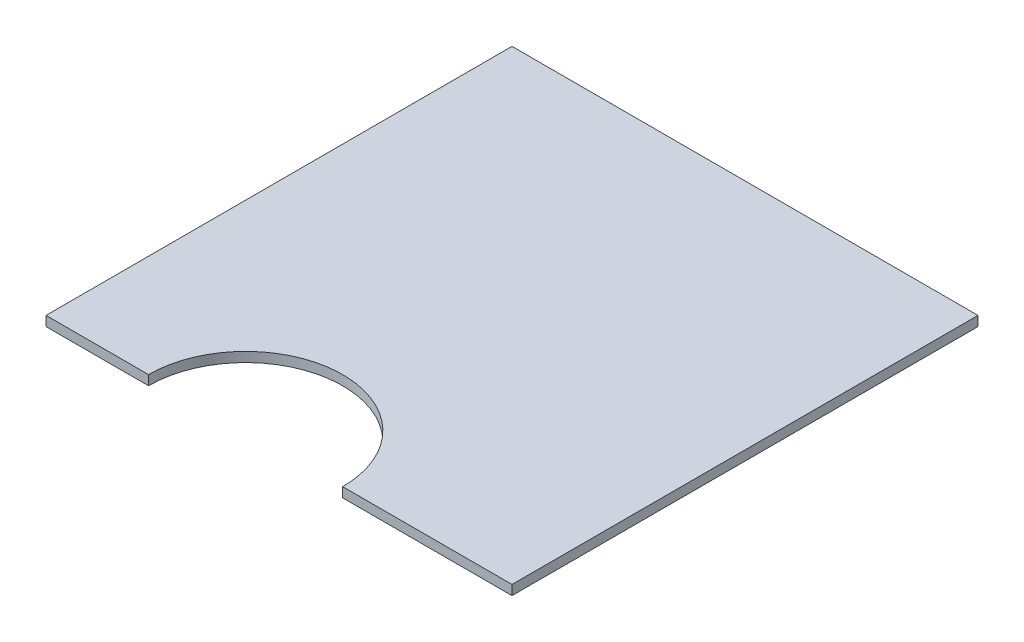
ISO-10303-21;
HEADER;
FILE_DESCRIPTION(('STEP AP214'),'2;1');
FILE_NAME('part.step','',(''),(''),'','','');
FILE_SCHEMA(('AUTOMOTIVE_DESIGN { 1 0 10303 214 1 1 1 1 }'));
ENDSEC;
DATA;
#1=APPLICATION_CONTEXT('core data for automotive mechanical design processes');
#2=APPLICATION_PROTOCOL_DEFINITION('international standard','automotive_design',2000,#1);
#3=PRODUCT_CONTEXT('',#1,'mechanical');
#4=PRODUCT('Part','Part','',(#3));
#5=PRODUCT_RELATED_PRODUCT_CATEGORY('part','',(#4));
#6=PRODUCT_DEFINITION_FORMATION('','',#4);
#7=PRODUCT_DEFINITION_CONTEXT('part definition',#1,'design');
#8=PRODUCT_DEFINITION('design','',#6,#7);
#9=PRODUCT_DEFINITION_SHAPE('','',#8);
#10=(LENGTH_UNIT() NAMED_UNIT(*) SI_UNIT(.MILLI.,.METRE.));
#11=(NAMED_UNIT(*) PLANE_ANGLE_UNIT() SI_UNIT($,.RADIAN.));
#12=(NAMED_UNIT(*) SI_UNIT($,.STERADIAN.) SOLID_ANGLE_UNIT());
#13=UNCERTAINTY_MEASURE_WITH_UNIT(LENGTH_MEASURE(1.E-05),#10,'distance_accuracy_value','');
#14=(GEOMETRIC_REPRESENTATION_CONTEXT(3) GLOBAL_UNCERTAINTY_ASSIGNED_CONTEXT((#13)) GLOBAL_UNIT_ASSIGNED_CONTEXT((#10,
#11,#12)) REPRESENTATION_CONTEXT('',''));
#15=CARTESIAN_POINT('',(0.,0.,0.));
#16=DIRECTION('',(0.,0.,1.));
#17=DIRECTION('',(1.,0.,0.));
#18=AXIS2_PLACEMENT_3D('',#15,#16,#17);
#19=CARTESIAN_POINT('',(-163.303385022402,6.35,27.2067696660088));
#20=DIRECTION('',(0.,-1.,0.));
#21=DIRECTION('',(0.,0.,-1.));
#22=AXIS2_PLACEMENT_3D('',#19,#20,#21);
#23=CYLINDRICAL_SURFACE('',#22,63.5);
#24=CARTESIAN_POINT('',(-163.303385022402,0.,27.2067696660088));
#25=DIRECTION('',(0.,1.,0.));
#26=DIRECTION('',(0.,0.,1.));
#27=AXIS2_PLACEMENT_3D('',#24,#25,#26);
#28=CIRCLE('',#27,63.5);
#29=CARTESIAN_POINT('',(-99.8033850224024,0.,27.2067696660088));
#30=VERTEX_POINT('',#29);
#31=CARTESIAN_POINT('',(-226.803385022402,0.,27.2067696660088));
#32=VERTEX_POINT('',#31);
#33=EDGE_CURVE('E115',#30,#32,#28,.T.);
#34=ORIENTED_EDGE('',*,*,#33,.F.);
#35=DIRECTION('',(0.,-1.,0.));
#36=VECTOR('',#35,1.);
#37=CARTESIAN_POINT('',(-99.8033850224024,6.35,27.2067696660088));
#38=LINE('',#37,#36);
#39=CARTESIAN_POINT('',(-99.8033850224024,6.35,27.2067696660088));
#40=VERTEX_POINT('',#39);
#41=EDGE_CURVE('E11',#40,#30,#38,.T.);
#42=ORIENTED_EDGE('',*,*,#41,.F.);
#43=CARTESIAN_POINT('',(-163.303385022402,6.35,27.2067696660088));
#44=DIRECTION('',(0.,1.,0.));
#45=DIRECTION('',(0.,0.,1.));
#46=AXIS2_PLACEMENT_3D('',#43,#44,#45);
#47=CIRCLE('',#46,63.5);
#48=CARTESIAN_POINT('',(-226.803385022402,6.35,27.2067696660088));
#49=VERTEX_POINT('',#48);
#50=EDGE_CURVE('E138',#40,#49,#47,.T.);
#51=ORIENTED_EDGE('',*,*,#50,.T.);
#52=DIRECTION('',(0.,-1.,0.));
#53=VECTOR('',#52,1.);
#54=CARTESIAN_POINT('',(-226.803385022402,6.35,27.2067696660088));
#55=LINE('',#54,#53);
#56=EDGE_CURVE('E77',#49,#32,#55,.T.);
#57=ORIENTED_EDGE('',*,*,#56,.T.);
#58=EDGE_LOOP('',(#34,#42,#51,#57));
#59=FACE_BOUND('',#58,.T.);
#60=ADVANCED_FACE('F33',(#59),#23,.F.);
#61=CARTESIAN_POINT('',(-476.867271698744,6.35,27.2067696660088));
#62=DIRECTION('',(0.,0.,-1.));
#63=DIRECTION('',(-1.,0.,0.));
#64=AXIS2_PLACEMENT_3D('',#61,#62,#63);
#65=PLANE('',#64);
#66=DIRECTION('',(1.,0.,0.));
#67=VECTOR('',#66,1.);
#68=CARTESIAN_POINT('',(-476.867271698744,0.,27.2067696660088));
#69=LINE('',#68,#67);
#70=CARTESIAN_POINT('',(10.9541496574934,0.,27.2067696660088));
#71=VERTEX_POINT('',#70);
#72=EDGE_CURVE('E118',#30,#71,#69,.T.);
#73=ORIENTED_EDGE('',*,*,#72,.T.);
#74=DIRECTION('',(0.,-1.,0.));
#75=VECTOR('',#74,1.);
#76=CARTESIAN_POINT('',(10.9541496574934,6.35,27.2067696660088));
#77=LINE('',#76,#75);
#78=CARTESIAN_POINT('',(10.9541496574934,6.35,27.2067696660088));
#79=VERTEX_POINT('',#78);
#80=EDGE_CURVE('E41',#79,#71,#77,.T.);
#81=ORIENTED_EDGE('',*,*,#80,.F.);
#82=DIRECTION('',(1.,0.,0.));
#83=VECTOR('',#82,1.);
#84=CARTESIAN_POINT('',(-476.867271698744,6.35,27.2067696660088));
#85=LINE('',#84,#83);
#86=EDGE_CURVE('E112',#40,#79,#85,.T.);
#87=ORIENTED_EDGE('',*,*,#86,.F.);
#88=ORIENTED_EDGE('',*,*,#41,.T.);
#89=EDGE_LOOP('',(#73,#81,#87,#88));
#90=FACE_BOUND('',#89,.T.);
#91=ADVANCED_FACE('F140',(#90),#65,.F.);
#92=CARTESIAN_POINT('',(10.9541496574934,6.35,-125.193230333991));
#93=DIRECTION('',(-1.,0.,0.));
#94=DIRECTION('',(0.,0.,1.));
#95=AXIS2_PLACEMENT_3D('',#92,#93,#94);
#96=PLANE('',#95);
#97=DIRECTION('',(0.,0.,-1.));
#98=VECTOR('',#97,1.);
#99=CARTESIAN_POINT('',(10.9541496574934,0.,-125.193230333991));
#100=LINE('',#99,#98);
#101=CARTESIAN_POINT('',(10.9541496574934,0.,-277.593230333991));
#102=VERTEX_POINT('',#101);
#103=EDGE_CURVE('E120',#71,#102,#100,.T.);
#104=ORIENTED_EDGE('',*,*,#103,.T.);
#105=DIRECTION('',(0.,-1.,0.));
#106=VECTOR('',#105,1.);
#107=CARTESIAN_POINT('',(10.9541496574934,6.35,-277.593230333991));
#108=LINE('',#107,#106);
#109=CARTESIAN_POINT('',(10.9541496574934,6.35,-277.593230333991));
#110=VERTEX_POINT('',#109);
#111=EDGE_CURVE('E101',#110,#102,#108,.T.);
#112=ORIENTED_EDGE('',*,*,#111,.F.);
#113=DIRECTION('',(0.,0.,-1.));
#114=VECTOR('',#113,1.);
#115=CARTESIAN_POINT('',(10.9541496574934,6.35,-125.193230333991));
#116=LINE('',#115,#114);
#117=EDGE_CURVE('E106',#79,#110,#116,.T.);
#118=ORIENTED_EDGE('',*,*,#117,.F.);
#119=ORIENTED_EDGE('',*,*,#80,.T.);
#120=EDGE_LOOP('',(#104,#112,#118,#119));
#121=FACE_BOUND('',#120,.T.);
#122=ADVANCED_FACE('F133',(#121),#96,.F.);
#123=CARTESIAN_POINT('',(-476.867271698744,6.35,-277.593230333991));
#124=DIRECTION('',(0.,0.,-1.));
#125=DIRECTION('',(-1.,0.,0.));
#126=AXIS2_PLACEMENT_3D('',#123,#124,#125);
#127=PLANE('',#126);
#128=DIRECTION('',(1.,0.,0.));
#129=VECTOR('',#128,1.);
#130=CARTESIAN_POINT('',(-476.867271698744,0.,-277.593230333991));
#131=LINE('',#130,#129);
#132=CARTESIAN_POINT('',(-293.845850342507,0.,-277.593230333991));
#133=VERTEX_POINT('',#132);
#134=EDGE_CURVE('E96',#133,#102,#131,.T.);
#135=ORIENTED_EDGE('',*,*,#134,.F.);
#136=DIRECTION('',(0.,-1.,0.));
#137=VECTOR('',#136,1.);
#138=CARTESIAN_POINT('',(-293.845850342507,6.35,-277.593230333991));
#139=LINE('',#138,#137);
#140=CARTESIAN_POINT('',(-293.845850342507,6.35,-277.593230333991));
#141=VERTEX_POINT('',#140);
#142=EDGE_CURVE('E91',#141,#133,#139,.T.);
#143=ORIENTED_EDGE('',*,*,#142,.F.);
#144=DIRECTION('',(1.,0.,0.));
#145=VECTOR('',#144,1.);
#146=CARTESIAN_POINT('',(-476.867271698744,6.35,-277.593230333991));
#147=LINE('',#146,#145);
#148=EDGE_CURVE('E94',#141,#110,#147,.T.);
#149=ORIENTED_EDGE('',*,*,#148,.T.);
#150=ORIENTED_EDGE('',*,*,#111,.T.);
#151=EDGE_LOOP('',(#135,#143,#149,#150));
#152=FACE_BOUND('',#151,.T.);
#153=ADVANCED_FACE('F93',(#152),#127,.T.);
#154=CARTESIAN_POINT('',(-293.845850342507,6.35,-125.193230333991));
#155=DIRECTION('',(-1.,0.,0.));
#156=DIRECTION('',(0.,0.,1.));
#157=AXIS2_PLACEMENT_3D('',#154,#155,#156);
#158=PLANE('',#157);
#159=DIRECTION('',(0.,0.,-1.));
#160=VECTOR('',#159,1.);
#161=CARTESIAN_POINT('',(-293.845850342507,0.,-125.193230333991));
#162=LINE('',#161,#160);
#163=CARTESIAN_POINT('',(-293.845850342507,0.,27.2067696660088));
#164=VERTEX_POINT('',#163);
#165=EDGE_CURVE('E125',#164,#133,#162,.T.);
#166=ORIENTED_EDGE('',*,*,#165,.F.);
#167=DIRECTION('',(0.,-1.,0.));
#168=VECTOR('',#167,1.);
#169=CARTESIAN_POINT('',(-293.845850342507,6.35,27.2067696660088));
#170=LINE('',#169,#168);
#171=CARTESIAN_POINT('',(-293.845850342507,6.35,27.2067696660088));
#172=VERTEX_POINT('',#171);
#173=EDGE_CURVE('E70',#172,#164,#170,.T.);
#174=ORIENTED_EDGE('',*,*,#173,.F.);
#175=DIRECTION('',(0.,0.,-1.));
#176=VECTOR('',#175,1.);
#177=CARTESIAN_POINT('',(-293.845850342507,6.35,-125.193230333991));
#178=LINE('',#177,#176);
#179=EDGE_CURVE('E104',#172,#141,#178,.T.);
#180=ORIENTED_EDGE('',*,*,#179,.T.);
#181=ORIENTED_EDGE('',*,*,#142,.T.);
#182=EDGE_LOOP('',(#166,#174,#180,#181));
#183=FACE_BOUND('',#182,.T.);
#184=ADVANCED_FACE('F109',(#183),#158,.T.);
#185=EDGE_CURVE('E121',#164,#32,#69,.T.);
#186=ORIENTED_EDGE('',*,*,#185,.T.);
#187=ORIENTED_EDGE('',*,*,#56,.F.);
#188=EDGE_CURVE('E49',#172,#49,#85,.T.);
#189=ORIENTED_EDGE('',*,*,#188,.F.);
#190=ORIENTED_EDGE('',*,*,#173,.T.);
#191=EDGE_LOOP('',(#186,#187,#189,#190));
#192=FACE_BOUND('',#191,.T.);
#193=ADVANCED_FACE('F143',(#192),#65,.F.);
#194=CARTESIAN_POINT('',(-476.867271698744,6.35,-125.193230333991));
#195=DIRECTION('',(0.,1.,0.));
#196=DIRECTION('',(0.,0.,1.));
#197=AXIS2_PLACEMENT_3D('',#194,#195,#196);
#198=PLANE('',#197);
#199=ORIENTED_EDGE('',*,*,#50,.F.);
#200=ORIENTED_EDGE('',*,*,#86,.T.);
#201=ORIENTED_EDGE('',*,*,#117,.T.);
#202=ORIENTED_EDGE('',*,*,#148,.F.);
#203=ORIENTED_EDGE('',*,*,#179,.F.);
#204=ORIENTED_EDGE('',*,*,#188,.T.);
#205=EDGE_LOOP('',(#199,#200,#201,#202,#203,#204));
#206=FACE_BOUND('',#205,.T.);
#207=ADVANCED_FACE('F103',(#206),#198,.T.);
#208=CARTESIAN_POINT('',(-476.867271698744,0.,-125.193230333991));
#209=DIRECTION('',(0.,1.,0.));
#210=DIRECTION('',(0.,0.,1.));
#211=AXIS2_PLACEMENT_3D('',#208,#209,#210);
#212=PLANE('',#211);
#213=ORIENTED_EDGE('',*,*,#33,.T.);
#214=ORIENTED_EDGE('',*,*,#185,.F.);
#215=ORIENTED_EDGE('',*,*,#165,.T.);
#216=ORIENTED_EDGE('',*,*,#134,.T.);
#217=ORIENTED_EDGE('',*,*,#103,.F.);
#218=ORIENTED_EDGE('',*,*,#72,.F.);
#219=EDGE_LOOP('',(#213,#214,#215,#216,#217,#218));
#220=FACE_BOUND('',#219,.T.);
#221=ADVANCED_FACE('F137',(#220),#212,.F.);
#222=CLOSED_SHELL('',(#60,#91,#122,#153,#184,#193,#207,#221));
#223=MANIFOLD_SOLID_BREP('B2',#222);
#224=ADVANCED_BREP_SHAPE_REPRESENTATION('',(#18,#223),#14);
#225=SHAPE_DEFINITION_REPRESENTATION(#9,#224);
ENDSEC;
END-ISO-10303-21;
